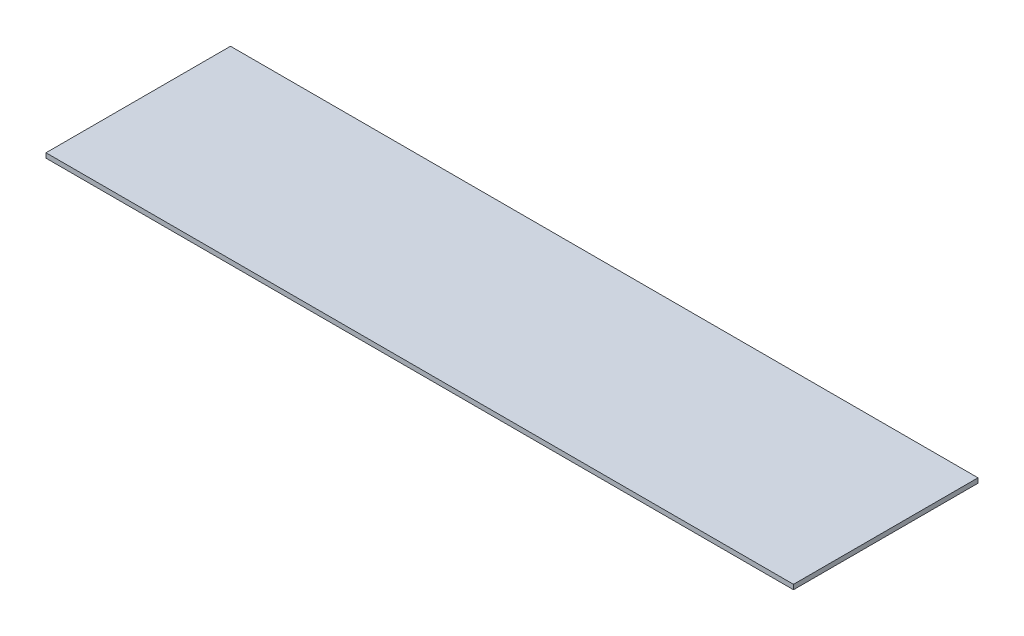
from build123d import *

# Parameters (mm, degrees)
SKETCH1_W           = 1003.3
SKETCH1_H           = 247.65
BOSS_EXTRUDE1_DEPTH = 6.35


with BuildPart() as part:
    # Sketch1 → Boss-Extrude1 (new body)
    with BuildSketch(Plane(origin=(0, 0, 0), x_dir=(1, 0, 0), z_dir=(0, 1, 0))):
        Rectangle(SKETCH1_W, SKETCH1_H)
    extrude(amount=BOSS_EXTRUDE1_DEPTH)


solid = part.part
